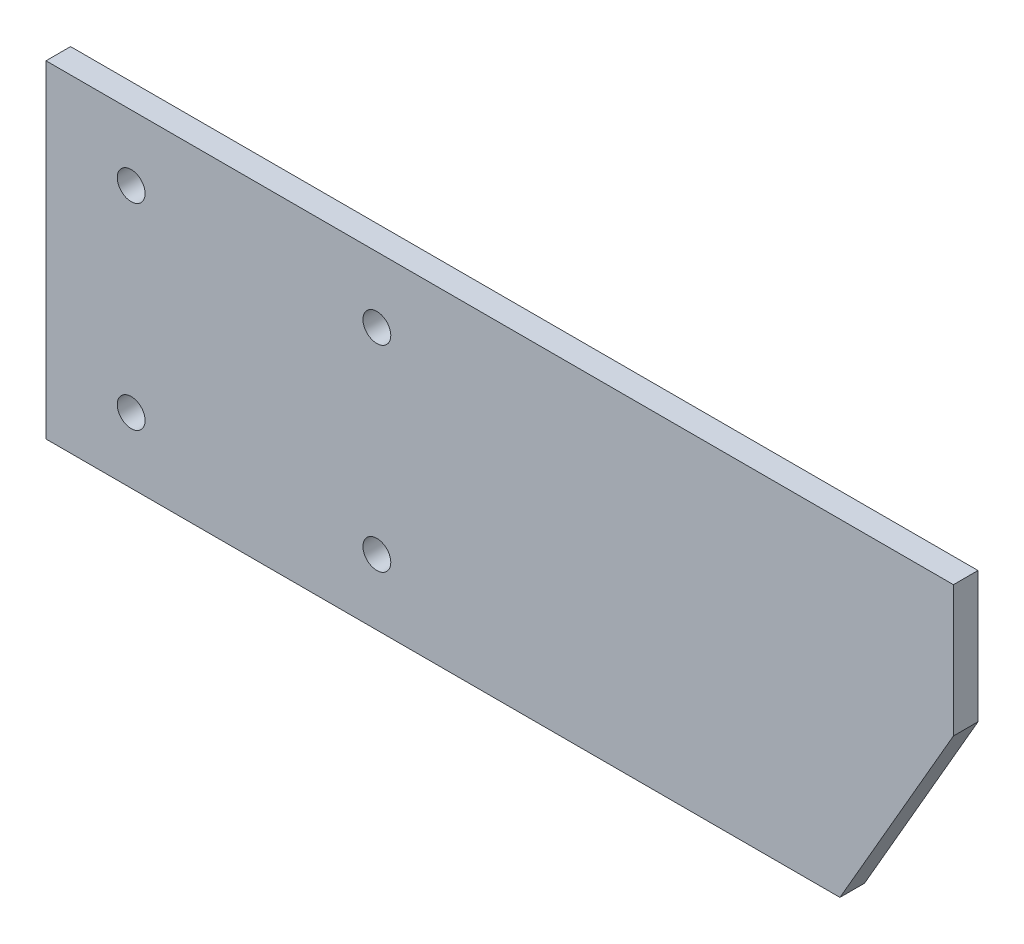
ISO-10303-21;
HEADER;
FILE_DESCRIPTION(('STEP AP214'),'2;1');
FILE_NAME('part.step','',(''),(''),'','','');
FILE_SCHEMA(('AUTOMOTIVE_DESIGN { 1 0 10303 214 1 1 1 1 }'));
ENDSEC;
DATA;
#1=APPLICATION_CONTEXT('core data for automotive mechanical design processes');
#2=APPLICATION_PROTOCOL_DEFINITION('international standard','automotive_design',2000,#1);
#3=PRODUCT_CONTEXT('',#1,'mechanical');
#4=PRODUCT('Part','Part','',(#3));
#5=PRODUCT_RELATED_PRODUCT_CATEGORY('part','',(#4));
#6=PRODUCT_DEFINITION_FORMATION('','',#4);
#7=PRODUCT_DEFINITION_CONTEXT('part definition',#1,'design');
#8=PRODUCT_DEFINITION('design','',#6,#7);
#9=PRODUCT_DEFINITION_SHAPE('','',#8);
#10=(LENGTH_UNIT() NAMED_UNIT(*) SI_UNIT(.MILLI.,.METRE.));
#11=(NAMED_UNIT(*) PLANE_ANGLE_UNIT() SI_UNIT($,.RADIAN.));
#12=(NAMED_UNIT(*) SI_UNIT($,.STERADIAN.) SOLID_ANGLE_UNIT());
#13=UNCERTAINTY_MEASURE_WITH_UNIT(LENGTH_MEASURE(1.E-05),#10,'distance_accuracy_value','');
#14=(GEOMETRIC_REPRESENTATION_CONTEXT(3) GLOBAL_UNCERTAINTY_ASSIGNED_CONTEXT((#13)) GLOBAL_UNIT_ASSIGNED_CONTEXT((#10,
#11,#12)) REPRESENTATION_CONTEXT('',''));
#15=CARTESIAN_POINT('',(0.,0.,0.));
#16=DIRECTION('',(0.,0.,1.));
#17=DIRECTION('',(1.,0.,0.));
#18=AXIS2_PLACEMENT_3D('',#15,#16,#17);
#19=CARTESIAN_POINT('',(-127.,-100.,0.));
#20=DIRECTION('',(0.,0.,1.));
#21=DIRECTION('',(1.,0.,0.));
#22=AXIS2_PLACEMENT_3D('',#19,#20,#21);
#23=PLANE('',#22);
#24=DIRECTION('',(0.,-1.,0.));
#25=VECTOR('',#24,1.);
#26=CARTESIAN_POINT('',(127.,-100.,0.));
#27=LINE('',#26,#25);
#28=CARTESIAN_POINT('',(127.,100.,0.));
#29=VERTEX_POINT('',#28);
#30=CARTESIAN_POINT('',(127.,-100.,0.));
#31=VERTEX_POINT('',#30);
#32=EDGE_CURVE('E11',#29,#31,#27,.T.);
#33=ORIENTED_EDGE('',*,*,#32,.F.);
#34=DIRECTION('',(-1.,0.,0.));
#35=VECTOR('',#34,1.);
#36=CARTESIAN_POINT('',(-127.,100.,0.));
#37=LINE('',#36,#35);
#38=CARTESIAN_POINT('',(427.,100.,0.));
#39=VERTEX_POINT('',#38);
#40=EDGE_CURVE('E104',#39,#29,#37,.T.);
#41=ORIENTED_EDGE('',*,*,#40,.F.);
#42=DIRECTION('',(0.,1.,0.));
#43=VECTOR('',#42,1.);
#44=CARTESIAN_POINT('',(427.,20.,0.));
#45=LINE('',#44,#43);
#46=CARTESIAN_POINT('',(427.,20.,0.));
#47=VERTEX_POINT('',#46);
#48=EDGE_CURVE('E121',#47,#39,#45,.T.);
#49=ORIENTED_EDGE('',*,*,#48,.F.);
#50=DIRECTION('',(0.499999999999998,0.86602540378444,0.));
#51=VECTOR('',#50,1.);
#52=CARTESIAN_POINT('',(357.717967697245,-100.,0.));
#53=LINE('',#52,#51);
#54=CARTESIAN_POINT('',(357.717967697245,-100.,0.));
#55=VERTEX_POINT('',#54);
#56=EDGE_CURVE('E123',#55,#47,#53,.T.);
#57=ORIENTED_EDGE('',*,*,#56,.F.);
#58=DIRECTION('',(1.,0.,0.));
#59=VECTOR('',#58,1.);
#60=CARTESIAN_POINT('',(-127.,-100.,0.));
#61=LINE('',#60,#59);
#62=EDGE_CURVE('E127',#31,#55,#61,.T.);
#63=ORIENTED_EDGE('',*,*,#62,.F.);
#64=EDGE_LOOP('',(#33,#41,#49,#57,#63));
#65=FACE_BOUND('',#64,.T.);
#66=ADVANCED_FACE('F33',(#65),#23,.F.);
#67=CARTESIAN_POINT('',(-127.,-100.,15.));
#68=DIRECTION('',(0.,0.,1.));
#69=DIRECTION('',(1.,0.,0.));
#70=AXIS2_PLACEMENT_3D('',#67,#68,#69);
#71=PLANE('',#70);
#72=CARTESIAN_POINT('',(75.,-60.,15.));
#73=DIRECTION('',(0.,0.,1.));
#74=DIRECTION('',(1.,0.,0.));
#75=AXIS2_PLACEMENT_3D('',#72,#73,#74);
#76=CIRCLE('',#75,8.5);
#77=CARTESIAN_POINT('',(83.5,-60.,15.));
#78=VERTEX_POINT('',#77);
#79=EDGE_CURVE('E143',#78,#78,#76,.T.);
#80=ORIENTED_EDGE('',*,*,#79,.F.);
#81=EDGE_LOOP('',(#80));
#82=FACE_BOUND('',#81,.T.);
#83=CARTESIAN_POINT('',(-75.,60.,15.));
#84=DIRECTION('',(0.,0.,1.));
#85=DIRECTION('',(1.,0.,0.));
#86=AXIS2_PLACEMENT_3D('',#83,#84,#85);
#87=CIRCLE('',#86,8.50000000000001);
#88=CARTESIAN_POINT('',(-66.5,60.,15.));
#89=VERTEX_POINT('',#88);
#90=EDGE_CURVE('E129',#89,#89,#87,.T.);
#91=ORIENTED_EDGE('',*,*,#90,.F.);
#92=EDGE_LOOP('',(#91));
#93=FACE_BOUND('',#92,.T.);
#94=DIRECTION('',(0.,-1.,0.));
#95=VECTOR('',#94,1.);
#96=CARTESIAN_POINT('',(-127.,100.,15.));
#97=LINE('',#96,#95);
#98=CARTESIAN_POINT('',(-127.,100.,15.));
#99=VERTEX_POINT('',#98);
#100=CARTESIAN_POINT('',(-127.,-100.,15.));
#101=VERTEX_POINT('',#100);
#102=EDGE_CURVE('E94',#99,#101,#97,.T.);
#103=ORIENTED_EDGE('',*,*,#102,.T.);
#104=DIRECTION('',(1.,0.,0.));
#105=VECTOR('',#104,1.);
#106=CARTESIAN_POINT('',(-127.,-100.,15.));
#107=LINE('',#106,#105);
#108=CARTESIAN_POINT('',(357.717967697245,-100.,15.));
#109=VERTEX_POINT('',#108);
#110=EDGE_CURVE('E83',#101,#109,#107,.T.);
#111=ORIENTED_EDGE('',*,*,#110,.T.);
#112=DIRECTION('',(0.499999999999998,0.86602540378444,0.));
#113=VECTOR('',#112,1.);
#114=CARTESIAN_POINT('',(357.717967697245,-100.,15.));
#115=LINE('',#114,#113);
#116=CARTESIAN_POINT('',(427.,20.,15.));
#117=VERTEX_POINT('',#116);
#118=EDGE_CURVE('E93',#109,#117,#115,.T.);
#119=ORIENTED_EDGE('',*,*,#118,.T.);
#120=DIRECTION('',(0.,1.,0.));
#121=VECTOR('',#120,1.);
#122=CARTESIAN_POINT('',(427.,20.,15.));
#123=LINE('',#122,#121);
#124=CARTESIAN_POINT('',(427.,100.,15.));
#125=VERTEX_POINT('',#124);
#126=EDGE_CURVE('E131',#117,#125,#123,.T.);
#127=ORIENTED_EDGE('',*,*,#126,.T.);
#128=DIRECTION('',(-1.,0.,0.));
#129=VECTOR('',#128,1.);
#130=CARTESIAN_POINT('',(-127.,100.,15.));
#131=LINE('',#130,#129);
#132=EDGE_CURVE('E100',#125,#99,#131,.T.);
#133=ORIENTED_EDGE('',*,*,#132,.T.);
#134=EDGE_LOOP('',(#103,#111,#119,#127,#133));
#135=FACE_BOUND('',#134,.T.);
#136=CARTESIAN_POINT('',(75.,60.,15.));
#137=DIRECTION('',(0.,0.,1.));
#138=DIRECTION('',(1.,0.,0.));
#139=AXIS2_PLACEMENT_3D('',#136,#137,#138);
#140=CIRCLE('',#139,8.5);
#141=CARTESIAN_POINT('',(83.5,60.,15.));
#142=VERTEX_POINT('',#141);
#143=EDGE_CURVE('E137',#142,#142,#140,.T.);
#144=ORIENTED_EDGE('',*,*,#143,.F.);
#145=EDGE_LOOP('',(#144));
#146=FACE_BOUND('',#145,.T.);
#147=CARTESIAN_POINT('',(-75.,-60.,15.));
#148=DIRECTION('',(0.,0.,1.));
#149=DIRECTION('',(1.,0.,0.));
#150=AXIS2_PLACEMENT_3D('',#147,#148,#149);
#151=CIRCLE('',#150,8.50000000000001);
#152=CARTESIAN_POINT('',(-66.5,-60.,15.));
#153=VERTEX_POINT('',#152);
#154=EDGE_CURVE('E149',#153,#153,#151,.T.);
#155=ORIENTED_EDGE('',*,*,#154,.F.);
#156=EDGE_LOOP('',(#155));
#157=FACE_BOUND('',#156,.T.);
#158=ADVANCED_FACE('F97',(#82,#93,#135,#146,#157),#71,.T.);
#159=CARTESIAN_POINT('',(75.,-60.,0.));
#160=DIRECTION('',(0.,0.,1.));
#161=DIRECTION('',(1.,0.,0.));
#162=AXIS2_PLACEMENT_3D('',#159,#160,#161);
#163=CIRCLE('',#162,8.5);
#164=CARTESIAN_POINT('',(83.5,-60.,0.));
#165=VERTEX_POINT('',#164);
#166=EDGE_CURVE('E146',#165,#165,#163,.T.);
#167=ORIENTED_EDGE('',*,*,#166,.T.);
#168=EDGE_LOOP('',(#167));
#169=FACE_BOUND('',#168,.T.);
#170=CARTESIAN_POINT('',(-75.,60.,0.));
#171=DIRECTION('',(0.,0.,1.));
#172=DIRECTION('',(1.,0.,0.));
#173=AXIS2_PLACEMENT_3D('',#170,#171,#172);
#174=CIRCLE('',#173,8.50000000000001);
#175=CARTESIAN_POINT('',(-66.5,60.,0.));
#176=VERTEX_POINT('',#175);
#177=EDGE_CURVE('E134',#176,#176,#174,.T.);
#178=ORIENTED_EDGE('',*,*,#177,.T.);
#179=EDGE_LOOP('',(#178));
#180=FACE_BOUND('',#179,.T.);
#181=CARTESIAN_POINT('',(-127.,100.,0.));
#182=VERTEX_POINT('',#181);
#183=EDGE_CURVE('E120',#29,#182,#37,.T.);
#184=ORIENTED_EDGE('',*,*,#183,.F.);
#185=ORIENTED_EDGE('',*,*,#32,.T.);
#186=CARTESIAN_POINT('',(-127.,-100.,0.));
#187=VERTEX_POINT('',#186);
#188=EDGE_CURVE('E125',#187,#31,#61,.T.);
#189=ORIENTED_EDGE('',*,*,#188,.F.);
#190=DIRECTION('',(0.,-1.,0.));
#191=VECTOR('',#190,1.);
#192=CARTESIAN_POINT('',(-127.,100.,0.));
#193=LINE('',#192,#191);
#194=EDGE_CURVE('E107',#182,#187,#193,.T.);
#195=ORIENTED_EDGE('',*,*,#194,.F.);
#196=EDGE_LOOP('',(#184,#185,#189,#195));
#197=FACE_BOUND('',#196,.T.);
#198=CARTESIAN_POINT('',(75.,60.,0.));
#199=DIRECTION('',(0.,0.,1.));
#200=DIRECTION('',(1.,0.,0.));
#201=AXIS2_PLACEMENT_3D('',#198,#199,#200);
#202=CIRCLE('',#201,8.5);
#203=CARTESIAN_POINT('',(83.5,60.,0.));
#204=VERTEX_POINT('',#203);
#205=EDGE_CURVE('E140',#204,#204,#202,.T.);
#206=ORIENTED_EDGE('',*,*,#205,.T.);
#207=EDGE_LOOP('',(#206));
#208=FACE_BOUND('',#207,.T.);
#209=CARTESIAN_POINT('',(-75.,-60.,0.));
#210=DIRECTION('',(0.,0.,1.));
#211=DIRECTION('',(1.,0.,0.));
#212=AXIS2_PLACEMENT_3D('',#209,#210,#211);
#213=CIRCLE('',#212,8.50000000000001);
#214=CARTESIAN_POINT('',(-66.5,-60.,0.));
#215=VERTEX_POINT('',#214);
#216=EDGE_CURVE('E152',#215,#215,#213,.T.);
#217=ORIENTED_EDGE('',*,*,#216,.T.);
#218=EDGE_LOOP('',(#217));
#219=FACE_BOUND('',#218,.T.);
#220=ADVANCED_FACE('F162',(#169,#180,#197,#208,#219),#23,.F.);
#221=CARTESIAN_POINT('',(-127.,100.,15.));
#222=DIRECTION('',(1.,0.,0.));
#223=DIRECTION('',(0.,1.,0.));
#224=AXIS2_PLACEMENT_3D('',#221,#222,#223);
#225=PLANE('',#224);
#226=ORIENTED_EDGE('',*,*,#194,.T.);
#227=DIRECTION('',(0.,0.,-1.));
#228=VECTOR('',#227,1.);
#229=CARTESIAN_POINT('',(-127.,-100.,15.));
#230=LINE('',#229,#228);
#231=EDGE_CURVE('E42',#101,#187,#230,.T.);
#232=ORIENTED_EDGE('',*,*,#231,.F.);
#233=ORIENTED_EDGE('',*,*,#102,.F.);
#234=DIRECTION('',(0.,0.,-1.));
#235=VECTOR('',#234,1.);
#236=CARTESIAN_POINT('',(-127.,100.,15.));
#237=LINE('',#236,#235);
#238=EDGE_CURVE('E116',#99,#182,#237,.T.);
#239=ORIENTED_EDGE('',*,*,#238,.T.);
#240=EDGE_LOOP('',(#226,#232,#233,#239));
#241=FACE_BOUND('',#240,.T.);
#242=ADVANCED_FACE('F35',(#241),#225,.F.);
#243=CARTESIAN_POINT('',(-127.,-100.,15.));
#244=DIRECTION('',(0.,1.,0.));
#245=DIRECTION('',(0.,0.,1.));
#246=AXIS2_PLACEMENT_3D('',#243,#244,#245);
#247=PLANE('',#246);
#248=ORIENTED_EDGE('',*,*,#188,.T.);
#249=ORIENTED_EDGE('',*,*,#62,.T.);
#250=DIRECTION('',(0.,0.,-1.));
#251=VECTOR('',#250,1.);
#252=CARTESIAN_POINT('',(357.717967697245,-100.,15.));
#253=LINE('',#252,#251);
#254=EDGE_CURVE('E90',#109,#55,#253,.T.);
#255=ORIENTED_EDGE('',*,*,#254,.F.);
#256=ORIENTED_EDGE('',*,*,#110,.F.);
#257=ORIENTED_EDGE('',*,*,#231,.T.);
#258=EDGE_LOOP('',(#248,#249,#255,#256,#257));
#259=FACE_BOUND('',#258,.T.);
#260=ADVANCED_FACE('F86',(#259),#247,.F.);
#261=CARTESIAN_POINT('',(357.717967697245,-100.,15.));
#262=DIRECTION('',(-0.86602540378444,0.499999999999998,0.));
#263=DIRECTION('',(-0.499999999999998,-0.86602540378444,0.));
#264=AXIS2_PLACEMENT_3D('',#261,#262,#263);
#265=PLANE('',#264);
#266=ORIENTED_EDGE('',*,*,#56,.T.);
#267=DIRECTION('',(0.,0.,-1.));
#268=VECTOR('',#267,1.);
#269=CARTESIAN_POINT('',(427.,20.,15.));
#270=LINE('',#269,#268);
#271=EDGE_CURVE('E108',#117,#47,#270,.T.);
#272=ORIENTED_EDGE('',*,*,#271,.F.);
#273=ORIENTED_EDGE('',*,*,#118,.F.);
#274=ORIENTED_EDGE('',*,*,#254,.T.);
#275=EDGE_LOOP('',(#266,#272,#273,#274));
#276=FACE_BOUND('',#275,.T.);
#277=ADVANCED_FACE('F184',(#276),#265,.F.);
#278=CARTESIAN_POINT('',(427.,20.,15.));
#279=DIRECTION('',(-1.,0.,0.));
#280=DIRECTION('',(0.,0.,1.));
#281=AXIS2_PLACEMENT_3D('',#278,#279,#280);
#282=PLANE('',#281);
#283=ORIENTED_EDGE('',*,*,#48,.T.);
#284=DIRECTION('',(0.,0.,-1.));
#285=VECTOR('',#284,1.);
#286=CARTESIAN_POINT('',(427.,100.,15.));
#287=LINE('',#286,#285);
#288=EDGE_CURVE('E113',#125,#39,#287,.T.);
#289=ORIENTED_EDGE('',*,*,#288,.F.);
#290=ORIENTED_EDGE('',*,*,#126,.F.);
#291=ORIENTED_EDGE('',*,*,#271,.T.);
#292=EDGE_LOOP('',(#283,#289,#290,#291));
#293=FACE_BOUND('',#292,.T.);
#294=ADVANCED_FACE('F180',(#293),#282,.F.);
#295=CARTESIAN_POINT('',(-127.,100.,15.));
#296=DIRECTION('',(0.,-1.,0.));
#297=DIRECTION('',(0.,0.,-1.));
#298=AXIS2_PLACEMENT_3D('',#295,#296,#297);
#299=PLANE('',#298);
#300=ORIENTED_EDGE('',*,*,#40,.T.);
#301=ORIENTED_EDGE('',*,*,#183,.T.);
#302=ORIENTED_EDGE('',*,*,#238,.F.);
#303=ORIENTED_EDGE('',*,*,#132,.F.);
#304=ORIENTED_EDGE('',*,*,#288,.T.);
#305=EDGE_LOOP('',(#300,#301,#302,#303,#304));
#306=FACE_BOUND('',#305,.T.);
#307=ADVANCED_FACE('F177',(#306),#299,.F.);
#308=CARTESIAN_POINT('',(-75.,60.,15.));
#309=DIRECTION('',(0.,0.,-1.));
#310=DIRECTION('',(-1.,0.,0.));
#311=AXIS2_PLACEMENT_3D('',#308,#309,#310);
#312=CYLINDRICAL_SURFACE('',#311,8.50000000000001);
#313=ORIENTED_EDGE('',*,*,#90,.T.);
#314=EDGE_LOOP('',(#313));
#315=FACE_BOUND('',#314,.T.);
#316=ORIENTED_EDGE('',*,*,#177,.F.);
#317=EDGE_LOOP('',(#316));
#318=FACE_BOUND('',#317,.T.);
#319=ADVANCED_FACE('F174',(#315,#318),#312,.F.);
#320=CARTESIAN_POINT('',(75.,60.,15.));
#321=DIRECTION('',(0.,0.,-1.));
#322=DIRECTION('',(-1.,0.,0.));
#323=AXIS2_PLACEMENT_3D('',#320,#321,#322);
#324=CYLINDRICAL_SURFACE('',#323,8.5);
#325=ORIENTED_EDGE('',*,*,#143,.T.);
#326=EDGE_LOOP('',(#325));
#327=FACE_BOUND('',#326,.T.);
#328=ORIENTED_EDGE('',*,*,#205,.F.);
#329=EDGE_LOOP('',(#328));
#330=FACE_BOUND('',#329,.T.);
#331=ADVANCED_FACE('F227',(#327,#330),#324,.F.);
#332=CARTESIAN_POINT('',(75.,-60.,15.));
#333=DIRECTION('',(0.,0.,-1.));
#334=DIRECTION('',(-1.,0.,0.));
#335=AXIS2_PLACEMENT_3D('',#332,#333,#334);
#336=CYLINDRICAL_SURFACE('',#335,8.5);
#337=ORIENTED_EDGE('',*,*,#79,.T.);
#338=EDGE_LOOP('',(#337));
#339=FACE_BOUND('',#338,.T.);
#340=ORIENTED_EDGE('',*,*,#166,.F.);
#341=EDGE_LOOP('',(#340));
#342=FACE_BOUND('',#341,.T.);
#343=ADVANCED_FACE('F233',(#339,#342),#336,.F.);
#344=CARTESIAN_POINT('',(-75.,-60.,15.));
#345=DIRECTION('',(0.,0.,-1.));
#346=DIRECTION('',(-1.,0.,0.));
#347=AXIS2_PLACEMENT_3D('',#344,#345,#346);
#348=CYLINDRICAL_SURFACE('',#347,8.50000000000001);
#349=ORIENTED_EDGE('',*,*,#154,.T.);
#350=EDGE_LOOP('',(#349));
#351=FACE_BOUND('',#350,.T.);
#352=ORIENTED_EDGE('',*,*,#216,.F.);
#353=EDGE_LOOP('',(#352));
#354=FACE_BOUND('',#353,.T.);
#355=ADVANCED_FACE('F158',(#351,#354),#348,.F.);
#356=CLOSED_SHELL('',(#66,#158,#220,#242,#260,#277,#294,#307,#319,#331,#343,#355));
#357=MANIFOLD_SOLID_BREP('B2',#356);
#358=ADVANCED_BREP_SHAPE_REPRESENTATION('',(#18,#357),#14);
#359=SHAPE_DEFINITION_REPRESENTATION(#9,#358);
ENDSEC;
END-ISO-10303-21;
